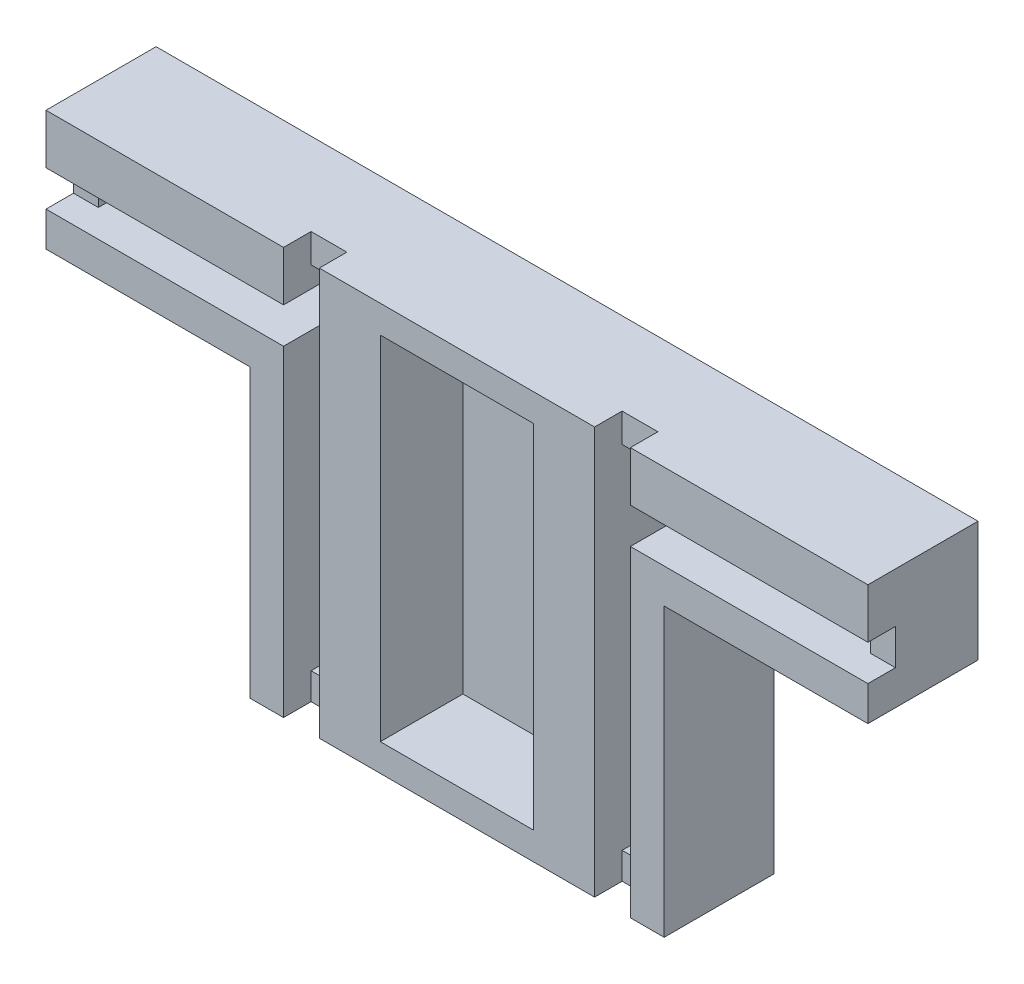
ISO-10303-21;
HEADER;
FILE_DESCRIPTION(('STEP AP214'),'2;1');
FILE_NAME('part.step','',(''),(''),'','','');
FILE_SCHEMA(('AUTOMOTIVE_DESIGN { 1 0 10303 214 1 1 1 1 }'));
ENDSEC;
DATA;
#1=APPLICATION_CONTEXT('core data for automotive mechanical design processes');
#2=APPLICATION_PROTOCOL_DEFINITION('international standard','automotive_design',2000,#1);
#3=PRODUCT_CONTEXT('',#1,'mechanical');
#4=PRODUCT('Part','Part','',(#3));
#5=PRODUCT_RELATED_PRODUCT_CATEGORY('part','',(#4));
#6=PRODUCT_DEFINITION_FORMATION('','',#4);
#7=PRODUCT_DEFINITION_CONTEXT('part definition',#1,'design');
#8=PRODUCT_DEFINITION('design','',#6,#7);
#9=PRODUCT_DEFINITION_SHAPE('','',#8);
#10=(LENGTH_UNIT() NAMED_UNIT(*) SI_UNIT(.MILLI.,.METRE.));
#11=(NAMED_UNIT(*) PLANE_ANGLE_UNIT() SI_UNIT($,.RADIAN.));
#12=(NAMED_UNIT(*) SI_UNIT($,.STERADIAN.) SOLID_ANGLE_UNIT());
#13=UNCERTAINTY_MEASURE_WITH_UNIT(LENGTH_MEASURE(1.E-05),#10,'distance_accuracy_value','');
#14=(GEOMETRIC_REPRESENTATION_CONTEXT(3) GLOBAL_UNCERTAINTY_ASSIGNED_CONTEXT((#13)) GLOBAL_UNIT_ASSIGNED_CONTEXT((#10,
#11,#12)) REPRESENTATION_CONTEXT('',''));
#15=CARTESIAN_POINT('',(0.,0.,0.));
#16=DIRECTION('',(0.,0.,1.));
#17=DIRECTION('',(1.,0.,0.));
#18=AXIS2_PLACEMENT_3D('',#15,#16,#17);
#19=CARTESIAN_POINT('',(0.,0.,20.));
#20=DIRECTION('',(0.,0.,-1.));
#21=DIRECTION('',(-1.,0.,0.));
#22=AXIS2_PLACEMENT_3D('',#19,#20,#21);
#23=PLANE('',#22);
#24=DIRECTION('',(0.,1.,0.));
#25=VECTOR('',#24,1.);
#26=CARTESIAN_POINT('',(60.7296788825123,0.,20.));
#27=LINE('',#26,#25);
#28=CARTESIAN_POINT('',(60.7296788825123,5.00000000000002,20.));
#29=VERTEX_POINT('',#28);
#30=CARTESIAN_POINT('',(60.7296788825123,68.97,20.));
#31=VERTEX_POINT('',#30);
#32=EDGE_CURVE('E446',#29,#31,#27,.T.);
#33=ORIENTED_EDGE('',*,*,#32,.T.);
#34=DIRECTION('',(-1.,0.,0.));
#35=VECTOR('',#34,1.);
#36=CARTESIAN_POINT('',(0.,68.97,20.));
#37=LINE('',#36,#35);
#38=CARTESIAN_POINT('',(88.5703211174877,68.97,20.));
#39=VERTEX_POINT('',#38);
#40=EDGE_CURVE('E451',#39,#31,#37,.T.);
#41=ORIENTED_EDGE('',*,*,#40,.F.);
#42=DIRECTION('',(0.,1.,0.));
#43=VECTOR('',#42,1.);
#44=CARTESIAN_POINT('',(88.5703211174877,0.,20.));
#45=LINE('',#44,#43);
#46=CARTESIAN_POINT('',(88.5703211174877,5.00000000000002,20.));
#47=VERTEX_POINT('',#46);
#48=EDGE_CURVE('E465',#47,#39,#45,.T.);
#49=ORIENTED_EDGE('',*,*,#48,.F.);
#50=DIRECTION('',(-1.,0.,0.));
#51=VECTOR('',#50,1.);
#52=CARTESIAN_POINT('',(0.,5.00000000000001,20.));
#53=LINE('',#52,#51);
#54=EDGE_CURVE('E462',#47,#29,#53,.T.);
#55=ORIENTED_EDGE('',*,*,#54,.T.);
#56=EDGE_LOOP('',(#33,#41,#49,#55));
#57=FACE_BOUND('',#56,.T.);
#58=DIRECTION('',(0.,-1.,0.));
#59=VECTOR('',#58,1.);
#60=CARTESIAN_POINT('',(99.65,0.,20.));
#61=LINE('',#60,#59);
#62=CARTESIAN_POINT('',(99.65,73.97,20.));
#63=VERTEX_POINT('',#62);
#64=CARTESIAN_POINT('',(99.65,0.,20.));
#65=VERTEX_POINT('',#64);
#66=EDGE_CURVE('E499',#63,#65,#61,.T.);
#67=ORIENTED_EDGE('',*,*,#66,.F.);
#68=DIRECTION('',(-1.,0.,0.));
#69=VECTOR('',#68,1.);
#70=CARTESIAN_POINT('',(0.,73.97,20.));
#71=LINE('',#70,#69);
#72=CARTESIAN_POINT('',(49.65,73.97,20.));
#73=VERTEX_POINT('',#72);
#74=EDGE_CURVE('E399',#63,#73,#71,.T.);
#75=ORIENTED_EDGE('',*,*,#74,.T.);
#76=DIRECTION('',(0.,-1.,0.));
#77=VECTOR('',#76,1.);
#78=CARTESIAN_POINT('',(49.65,0.,20.));
#79=LINE('',#78,#77);
#80=CARTESIAN_POINT('',(49.65,0.,20.));
#81=VERTEX_POINT('',#80);
#82=EDGE_CURVE('E351',#73,#81,#79,.T.);
#83=ORIENTED_EDGE('',*,*,#82,.T.);
#84=DIRECTION('',(1.,0.,0.));
#85=VECTOR('',#84,1.);
#86=CARTESIAN_POINT('',(0.,0.,20.));
#87=LINE('',#86,#85);
#88=EDGE_CURVE('E391',#81,#65,#87,.T.);
#89=ORIENTED_EDGE('',*,*,#88,.T.);
#90=EDGE_LOOP('',(#67,#75,#83,#89));
#91=FACE_BOUND('',#90,.T.);
#92=ADVANCED_FACE('F36',(#57,#91),#23,.F.);
#93=DIRECTION('',(0.,-1.,0.));
#94=VECTOR('',#93,1.);
#95=CARTESIAN_POINT('',(43.15,0.,20.));
#96=LINE('',#95,#94);
#97=CARTESIAN_POINT('',(43.15,73.97,20.));
#98=VERTEX_POINT('',#97);
#99=CARTESIAN_POINT('',(43.15,64.92,20.));
#100=VERTEX_POINT('',#99);
#101=EDGE_CURVE('E353',#98,#100,#96,.T.);
#102=ORIENTED_EDGE('',*,*,#101,.F.);
#103=CARTESIAN_POINT('',(0.,73.97,20.));
#104=VERTEX_POINT('',#103);
#105=EDGE_CURVE('E395',#98,#104,#71,.T.);
#106=ORIENTED_EDGE('',*,*,#105,.T.);
#107=DIRECTION('',(0.,-1.,0.));
#108=VECTOR('',#107,1.);
#109=CARTESIAN_POINT('',(0.,0.,20.));
#110=LINE('',#109,#108);
#111=CARTESIAN_POINT('',(0.,64.92,20.));
#112=VERTEX_POINT('',#111);
#113=EDGE_CURVE('E382',#104,#112,#110,.T.);
#114=ORIENTED_EDGE('',*,*,#113,.T.);
#115=DIRECTION('',(1.,0.,0.));
#116=VECTOR('',#115,1.);
#117=CARTESIAN_POINT('',(0.,64.92,20.));
#118=LINE('',#117,#116);
#119=EDGE_CURVE('E355',#112,#100,#118,.T.);
#120=ORIENTED_EDGE('',*,*,#119,.T.);
#121=EDGE_LOOP('',(#102,#106,#114,#120));
#122=FACE_BOUND('',#121,.T.);
#123=ADVANCED_FACE('F681',(#122),#23,.F.);
#124=DIRECTION('',(1.,0.,0.));
#125=VECTOR('',#124,1.);
#126=CARTESIAN_POINT('',(0.,58.42,20.));
#127=LINE('',#126,#125);
#128=CARTESIAN_POINT('',(0.,58.42,20.));
#129=VERTEX_POINT('',#128);
#130=CARTESIAN_POINT('',(43.15,58.42,20.));
#131=VERTEX_POINT('',#130);
#132=EDGE_CURVE('E332',#129,#131,#127,.T.);
#133=ORIENTED_EDGE('',*,*,#132,.F.);
#134=CARTESIAN_POINT('',(0.,52.121187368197,20.));
#135=VERTEX_POINT('',#134);
#136=EDGE_CURVE('E386',#129,#135,#110,.T.);
#137=ORIENTED_EDGE('',*,*,#136,.T.);
#138=DIRECTION('',(-1.,0.,0.));
#139=VECTOR('',#138,1.);
#140=CARTESIAN_POINT('',(0.,52.121187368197,20.));
#141=LINE('',#140,#139);
#142=CARTESIAN_POINT('',(37.0145690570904,52.121187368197,20.));
#143=VERTEX_POINT('',#142);
#144=EDGE_CURVE('E434',#143,#135,#141,.T.);
#145=ORIENTED_EDGE('',*,*,#144,.F.);
#146=DIRECTION('',(0.,1.,0.));
#147=VECTOR('',#146,1.);
#148=CARTESIAN_POINT('',(37.0145690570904,0.,20.));
#149=LINE('',#148,#147);
#150=CARTESIAN_POINT('',(37.0145690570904,0.,20.));
#151=VERTEX_POINT('',#150);
#152=EDGE_CURVE('E438',#151,#143,#149,.T.);
#153=ORIENTED_EDGE('',*,*,#152,.F.);
#154=CARTESIAN_POINT('',(43.15,0.,20.));
#155=VERTEX_POINT('',#154);
#156=EDGE_CURVE('E387',#151,#155,#87,.T.);
#157=ORIENTED_EDGE('',*,*,#156,.T.);
#158=EDGE_CURVE('E349',#131,#155,#96,.T.);
#159=ORIENTED_EDGE('',*,*,#158,.F.);
#160=EDGE_LOOP('',(#133,#137,#145,#153,#157,#159));
#161=FACE_BOUND('',#160,.T.);
#162=ADVANCED_FACE('F677',(#161),#23,.F.);
#163=CARTESIAN_POINT('',(4.50000000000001,0.,5.));
#164=DIRECTION('',(-1.,0.,0.));
#165=DIRECTION('',(0.,-1.,0.));
#166=AXIS2_PLACEMENT_3D('',#163,#164,#165);
#167=PLANE('',#166);
#168=DIRECTION('',(0.,1.,0.));
#169=VECTOR('',#168,1.);
#170=CARTESIAN_POINT('',(4.5,58.42,15.));
#171=LINE('',#170,#169);
#172=CARTESIAN_POINT('',(4.5,58.42,15.));
#173=VERTEX_POINT('',#172);
#174=CARTESIAN_POINT('',(4.5,64.92,15.));
#175=VERTEX_POINT('',#174);
#176=EDGE_CURVE('E552',#173,#175,#171,.T.);
#177=ORIENTED_EDGE('',*,*,#176,.F.);
#178=DIRECTION('',(0.,0.,1.));
#179=VECTOR('',#178,1.);
#180=CARTESIAN_POINT('',(4.5,58.42,5.));
#181=LINE('',#180,#179);
#182=CARTESIAN_POINT('',(4.5,58.42,5.));
#183=VERTEX_POINT('',#182);
#184=EDGE_CURVE('E363',#183,#173,#181,.T.);
#185=ORIENTED_EDGE('',*,*,#184,.F.);
#186=DIRECTION('',(0.,-1.,0.));
#187=VECTOR('',#186,1.);
#188=CARTESIAN_POINT('',(4.50000000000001,0.,5.));
#189=LINE('',#188,#187);
#190=CARTESIAN_POINT('',(4.5,64.92,5.));
#191=VERTEX_POINT('',#190);
#192=EDGE_CURVE('E342',#191,#183,#189,.T.);
#193=ORIENTED_EDGE('',*,*,#192,.F.);
#194=DIRECTION('',(0.,0.,1.));
#195=VECTOR('',#194,1.);
#196=CARTESIAN_POINT('',(4.5,64.92,5.));
#197=LINE('',#196,#195);
#198=EDGE_CURVE('E366',#191,#175,#197,.T.);
#199=ORIENTED_EDGE('',*,*,#198,.T.);
#200=EDGE_LOOP('',(#177,#185,#193,#199));
#201=FACE_BOUND('',#200,.T.);
#202=ADVANCED_FACE('F676',(#201),#167,.F.);
#203=DIRECTION('',(0.,-1.,0.));
#204=VECTOR('',#203,1.);
#205=CARTESIAN_POINT('',(106.15,0.,20.));
#206=LINE('',#205,#204);
#207=CARTESIAN_POINT('',(106.15,58.42,20.));
#208=VERTEX_POINT('',#207);
#209=CARTESIAN_POINT('',(106.15,0.,20.));
#210=VERTEX_POINT('',#209);
#211=EDGE_CURVE('E500',#208,#210,#206,.T.);
#212=ORIENTED_EDGE('',*,*,#211,.T.);
#213=CARTESIAN_POINT('',(112.28543094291,0.,20.));
#214=VERTEX_POINT('',#213);
#215=EDGE_CURVE('E385',#210,#214,#87,.T.);
#216=ORIENTED_EDGE('',*,*,#215,.T.);
#217=DIRECTION('',(0.,-1.,0.));
#218=VECTOR('',#217,1.);
#219=CARTESIAN_POINT('',(112.28543094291,0.,20.));
#220=LINE('',#219,#218);
#221=CARTESIAN_POINT('',(112.28543094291,52.121187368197,20.));
#222=VERTEX_POINT('',#221);
#223=EDGE_CURVE('E617',#222,#214,#220,.T.);
#224=ORIENTED_EDGE('',*,*,#223,.F.);
#225=DIRECTION('',(-1.,0.,0.));
#226=VECTOR('',#225,1.);
#227=CARTESIAN_POINT('',(149.3,52.121187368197,20.));
#228=LINE('',#227,#226);
#229=CARTESIAN_POINT('',(149.3,52.121187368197,20.));
#230=VERTEX_POINT('',#229);
#231=EDGE_CURVE('E610',#230,#222,#228,.T.);
#232=ORIENTED_EDGE('',*,*,#231,.F.);
#233=DIRECTION('',(0.,1.,0.));
#234=VECTOR('',#233,1.);
#235=CARTESIAN_POINT('',(149.3,0.,20.));
#236=LINE('',#235,#234);
#237=CARTESIAN_POINT('',(149.3,58.42,20.));
#238=VERTEX_POINT('',#237);
#239=EDGE_CURVE('E392',#230,#238,#236,.T.);
#240=ORIENTED_EDGE('',*,*,#239,.T.);
#241=DIRECTION('',(-1.,0.,0.));
#242=VECTOR('',#241,1.);
#243=CARTESIAN_POINT('',(0.,58.42,20.));
#244=LINE('',#243,#242);
#245=EDGE_CURVE('E483',#238,#208,#244,.T.);
#246=ORIENTED_EDGE('',*,*,#245,.T.);
#247=EDGE_LOOP('',(#212,#216,#224,#232,#240,#246));
#248=FACE_BOUND('',#247,.T.);
#249=ADVANCED_FACE('F636',(#248),#23,.F.);
#250=CARTESIAN_POINT('',(149.3,73.97,20.));
#251=VERTEX_POINT('',#250);
#252=CARTESIAN_POINT('',(106.15,73.97,20.));
#253=VERTEX_POINT('',#252);
#254=EDGE_CURVE('E396',#251,#253,#71,.T.);
#255=ORIENTED_EDGE('',*,*,#254,.T.);
#256=CARTESIAN_POINT('',(106.15,64.92,20.));
#257=VERTEX_POINT('',#256);
#258=EDGE_CURVE('E496',#253,#257,#206,.T.);
#259=ORIENTED_EDGE('',*,*,#258,.T.);
#260=DIRECTION('',(-1.,0.,0.));
#261=VECTOR('',#260,1.);
#262=CARTESIAN_POINT('',(0.,64.92,20.));
#263=LINE('',#262,#261);
#264=CARTESIAN_POINT('',(149.3,64.92,20.));
#265=VERTEX_POINT('',#264);
#266=EDGE_CURVE('E472',#265,#257,#263,.T.);
#267=ORIENTED_EDGE('',*,*,#266,.F.);
#268=EDGE_CURVE('E390',#265,#251,#236,.T.);
#269=ORIENTED_EDGE('',*,*,#268,.T.);
#270=EDGE_LOOP('',(#255,#259,#267,#269));
#271=FACE_BOUND('',#270,.T.);
#272=ADVANCED_FACE('F669',(#271),#23,.F.);
#273=CARTESIAN_POINT('',(0.,0.,20.));
#274=DIRECTION('',(1.,0.,0.));
#275=DIRECTION('',(0.,0.,-1.));
#276=AXIS2_PLACEMENT_3D('',#273,#274,#275);
#277=PLANE('',#276);
#278=ORIENTED_EDGE('',*,*,#136,.F.);
#279=DIRECTION('',(0.,0.,1.));
#280=VECTOR('',#279,1.);
#281=CARTESIAN_POINT('',(0.,58.42,15.));
#282=LINE('',#281,#280);
#283=CARTESIAN_POINT('',(0.,58.42,15.));
#284=VERTEX_POINT('',#283);
#285=EDGE_CURVE('E564',#284,#129,#282,.T.);
#286=ORIENTED_EDGE('',*,*,#285,.F.);
#287=DIRECTION('',(0.,-1.,0.));
#288=VECTOR('',#287,1.);
#289=CARTESIAN_POINT('',(0.,58.42,15.));
#290=LINE('',#289,#288);
#291=CARTESIAN_POINT('',(0.,64.92,15.));
#292=VERTEX_POINT('',#291);
#293=EDGE_CURVE('E559',#292,#284,#290,.T.);
#294=ORIENTED_EDGE('',*,*,#293,.F.);
#295=DIRECTION('',(0.,0.,1.));
#296=VECTOR('',#295,1.);
#297=CARTESIAN_POINT('',(0.,64.92,15.));
#298=LINE('',#297,#296);
#299=EDGE_CURVE('E563',#292,#112,#298,.T.);
#300=ORIENTED_EDGE('',*,*,#299,.T.);
#301=ORIENTED_EDGE('',*,*,#113,.F.);
#302=DIRECTION('',(0.,0.,-1.));
#303=VECTOR('',#302,1.);
#304=CARTESIAN_POINT('',(0.,73.97,20.));
#305=LINE('',#304,#303);
#306=CARTESIAN_POINT('',(0.,73.97,0.));
#307=VERTEX_POINT('',#306);
#308=EDGE_CURVE('E44',#104,#307,#305,.T.);
#309=ORIENTED_EDGE('',*,*,#308,.T.);
#310=DIRECTION('',(0.,-1.,0.));
#311=VECTOR('',#310,1.);
#312=CARTESIAN_POINT('',(0.,0.,0.));
#313=LINE('',#312,#311);
#314=CARTESIAN_POINT('',(0.,52.121187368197,0.));
#315=VERTEX_POINT('',#314);
#316=EDGE_CURVE('E362',#307,#315,#313,.T.);
#317=ORIENTED_EDGE('',*,*,#316,.T.);
#318=DIRECTION('',(0.,0.,1.));
#319=VECTOR('',#318,1.);
#320=CARTESIAN_POINT('',(0.,52.121187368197,0.));
#321=LINE('',#320,#319);
#322=EDGE_CURVE('E444',#315,#135,#321,.T.);
#323=ORIENTED_EDGE('',*,*,#322,.T.);
#324=EDGE_LOOP('',(#278,#286,#294,#300,#301,#309,#317,#323));
#325=FACE_BOUND('',#324,.T.);
#326=ADVANCED_FACE('F38',(#325),#277,.F.);
#327=CARTESIAN_POINT('',(0.,0.,20.));
#328=DIRECTION('',(0.,1.,0.));
#329=DIRECTION('',(0.,0.,1.));
#330=AXIS2_PLACEMENT_3D('',#327,#328,#329);
#331=PLANE('',#330);
#332=ORIENTED_EDGE('',*,*,#88,.F.);
#333=DIRECTION('',(0.,0.,1.));
#334=VECTOR('',#333,1.);
#335=CARTESIAN_POINT('',(49.65,0.,15.));
#336=LINE('',#335,#334);
#337=CARTESIAN_POINT('',(49.65,0.,15.));
#338=VERTEX_POINT('',#337);
#339=EDGE_CURVE('E580',#338,#81,#336,.T.);
#340=ORIENTED_EDGE('',*,*,#339,.F.);
#341=DIRECTION('',(1.,0.,0.));
#342=VECTOR('',#341,1.);
#343=CARTESIAN_POINT('',(49.65,0.,15.));
#344=LINE('',#343,#342);
#345=CARTESIAN_POINT('',(43.15,0.,15.));
#346=VERTEX_POINT('',#345);
#347=EDGE_CURVE('E576',#346,#338,#344,.T.);
#348=ORIENTED_EDGE('',*,*,#347,.F.);
#349=DIRECTION('',(0.,0.,1.));
#350=VECTOR('',#349,1.);
#351=CARTESIAN_POINT('',(43.15,0.,15.));
#352=LINE('',#351,#350);
#353=EDGE_CURVE('E579',#346,#155,#352,.T.);
#354=ORIENTED_EDGE('',*,*,#353,.T.);
#355=ORIENTED_EDGE('',*,*,#156,.F.);
#356=DIRECTION('',(0.,0.,1.));
#357=VECTOR('',#356,1.);
#358=CARTESIAN_POINT('',(37.0145690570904,0.,0.));
#359=LINE('',#358,#357);
#360=CARTESIAN_POINT('',(37.0145690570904,0.,0.));
#361=VERTEX_POINT('',#360);
#362=EDGE_CURVE('E430',#361,#151,#359,.T.);
#363=ORIENTED_EDGE('',*,*,#362,.F.);
#364=DIRECTION('',(1.,0.,0.));
#365=VECTOR('',#364,1.);
#366=CARTESIAN_POINT('',(0.,0.,0.));
#367=LINE('',#366,#365);
#368=CARTESIAN_POINT('',(112.28543094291,0.,0.));
#369=VERTEX_POINT('',#368);
#370=EDGE_CURVE('E402',#361,#369,#367,.T.);
#371=ORIENTED_EDGE('',*,*,#370,.T.);
#372=DIRECTION('',(0.,0.,1.));
#373=VECTOR('',#372,1.);
#374=CARTESIAN_POINT('',(112.28543094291,0.,0.));
#375=LINE('',#374,#373);
#376=EDGE_CURVE('E441',#369,#214,#375,.T.);
#377=ORIENTED_EDGE('',*,*,#376,.T.);
#378=ORIENTED_EDGE('',*,*,#215,.F.);
#379=DIRECTION('',(0.,0.,1.));
#380=VECTOR('',#379,1.);
#381=CARTESIAN_POINT('',(106.15,0.,15.));
#382=LINE('',#381,#380);
#383=CARTESIAN_POINT('',(106.15,0.,15.));
#384=VERTEX_POINT('',#383);
#385=EDGE_CURVE('E593',#384,#210,#382,.T.);
#386=ORIENTED_EDGE('',*,*,#385,.F.);
#387=DIRECTION('',(1.,0.,0.));
#388=VECTOR('',#387,1.);
#389=CARTESIAN_POINT('',(106.15,0.,15.));
#390=LINE('',#389,#388);
#391=CARTESIAN_POINT('',(99.65,0.,15.));
#392=VERTEX_POINT('',#391);
#393=EDGE_CURVE('E590',#392,#384,#390,.T.);
#394=ORIENTED_EDGE('',*,*,#393,.F.);
#395=DIRECTION('',(0.,0.,1.));
#396=VECTOR('',#395,1.);
#397=CARTESIAN_POINT('',(99.65,0.,15.));
#398=LINE('',#397,#396);
#399=EDGE_CURVE('E592',#392,#65,#398,.T.);
#400=ORIENTED_EDGE('',*,*,#399,.T.);
#401=EDGE_LOOP('',(#332,#340,#348,#354,#355,#363,#371,#377,#378,#386,#394,#400));
#402=FACE_BOUND('',#401,.T.);
#403=ADVANCED_FACE('F661',(#402),#331,.F.);
#404=CARTESIAN_POINT('',(149.3,0.,20.));
#405=DIRECTION('',(-1.,0.,0.));
#406=DIRECTION('',(0.,0.,1.));
#407=AXIS2_PLACEMENT_3D('',#404,#405,#406);
#408=PLANE('',#407);
#409=ORIENTED_EDGE('',*,*,#268,.F.);
#410=DIRECTION('',(0.,0.,1.));
#411=VECTOR('',#410,1.);
#412=CARTESIAN_POINT('',(149.3,64.92,15.));
#413=LINE('',#412,#411);
#414=CARTESIAN_POINT('',(149.3,64.92,15.));
#415=VERTEX_POINT('',#414);
#416=EDGE_CURVE('E607',#415,#265,#413,.T.);
#417=ORIENTED_EDGE('',*,*,#416,.F.);
#418=DIRECTION('',(0.,1.,0.));
#419=VECTOR('',#418,1.);
#420=CARTESIAN_POINT('',(149.3,58.42,15.));
#421=LINE('',#420,#419);
#422=CARTESIAN_POINT('',(149.3,58.42,15.));
#423=VERTEX_POINT('',#422);
#424=EDGE_CURVE('E602',#423,#415,#421,.T.);
#425=ORIENTED_EDGE('',*,*,#424,.F.);
#426=DIRECTION('',(0.,0.,1.));
#427=VECTOR('',#426,1.);
#428=CARTESIAN_POINT('',(149.3,58.42,15.));
#429=LINE('',#428,#427);
#430=EDGE_CURVE('E606',#423,#238,#429,.T.);
#431=ORIENTED_EDGE('',*,*,#430,.T.);
#432=ORIENTED_EDGE('',*,*,#239,.F.);
#433=DIRECTION('',(0.,0.,1.));
#434=VECTOR('',#433,1.);
#435=CARTESIAN_POINT('',(149.3,52.121187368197,0.));
#436=LINE('',#435,#434);
#437=CARTESIAN_POINT('',(149.3,52.121187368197,0.));
#438=VERTEX_POINT('',#437);
#439=EDGE_CURVE('E619',#438,#230,#436,.T.);
#440=ORIENTED_EDGE('',*,*,#439,.F.);
#441=DIRECTION('',(0.,1.,0.));
#442=VECTOR('',#441,1.);
#443=CARTESIAN_POINT('',(149.3,0.,0.));
#444=LINE('',#443,#442);
#445=CARTESIAN_POINT('',(149.3,73.97,0.));
#446=VERTEX_POINT('',#445);
#447=EDGE_CURVE('E405',#438,#446,#444,.T.);
#448=ORIENTED_EDGE('',*,*,#447,.T.);
#449=DIRECTION('',(0.,0.,-1.));
#450=VECTOR('',#449,1.);
#451=CARTESIAN_POINT('',(149.3,73.97,20.));
#452=LINE('',#451,#450);
#453=EDGE_CURVE('E11',#251,#446,#452,.T.);
#454=ORIENTED_EDGE('',*,*,#453,.F.);
#455=EDGE_LOOP('',(#409,#417,#425,#431,#432,#440,#448,#454));
#456=FACE_BOUND('',#455,.T.);
#457=ADVANCED_FACE('F638',(#456),#408,.F.);
#458=CARTESIAN_POINT('',(0.,73.97,20.));
#459=DIRECTION('',(0.,-1.,0.));
#460=DIRECTION('',(0.,0.,-1.));
#461=AXIS2_PLACEMENT_3D('',#458,#459,#460);
#462=PLANE('',#461);
#463=ORIENTED_EDGE('',*,*,#74,.F.);
#464=DIRECTION('',(0.,0.,1.));
#465=VECTOR('',#464,1.);
#466=CARTESIAN_POINT('',(99.65,73.97,15.));
#467=LINE('',#466,#465);
#468=CARTESIAN_POINT('',(99.65,73.97,15.));
#469=VERTEX_POINT('',#468);
#470=EDGE_CURVE('E537',#469,#63,#467,.T.);
#471=ORIENTED_EDGE('',*,*,#470,.F.);
#472=DIRECTION('',(-1.,0.,0.));
#473=VECTOR('',#472,1.);
#474=CARTESIAN_POINT('',(99.65,73.97,15.));
#475=LINE('',#474,#473);
#476=CARTESIAN_POINT('',(106.15,73.97,15.));
#477=VERTEX_POINT('',#476);
#478=EDGE_CURVE('E296',#477,#469,#475,.T.);
#479=ORIENTED_EDGE('',*,*,#478,.F.);
#480=DIRECTION('',(0.,0.,1.));
#481=VECTOR('',#480,1.);
#482=CARTESIAN_POINT('',(106.15,73.97,15.));
#483=LINE('',#482,#481);
#484=EDGE_CURVE('E533',#477,#253,#483,.T.);
#485=ORIENTED_EDGE('',*,*,#484,.T.);
#486=ORIENTED_EDGE('',*,*,#254,.F.);
#487=ORIENTED_EDGE('',*,*,#453,.T.);
#488=DIRECTION('',(-1.,0.,0.));
#489=VECTOR('',#488,1.);
#490=CARTESIAN_POINT('',(0.,73.97,0.));
#491=LINE('',#490,#489);
#492=EDGE_CURVE('E407',#446,#307,#491,.T.);
#493=ORIENTED_EDGE('',*,*,#492,.T.);
#494=ORIENTED_EDGE('',*,*,#308,.F.);
#495=ORIENTED_EDGE('',*,*,#105,.F.);
#496=DIRECTION('',(0.,0.,1.));
#497=VECTOR('',#496,1.);
#498=CARTESIAN_POINT('',(43.15,73.97,15.));
#499=LINE('',#498,#497);
#500=CARTESIAN_POINT('',(43.15,73.97,15.));
#501=VERTEX_POINT('',#500);
#502=EDGE_CURVE('E549',#501,#98,#499,.T.);
#503=ORIENTED_EDGE('',*,*,#502,.F.);
#504=DIRECTION('',(-1.,0.,0.));
#505=VECTOR('',#504,1.);
#506=CARTESIAN_POINT('',(43.15,73.97,15.));
#507=LINE('',#506,#505);
#508=CARTESIAN_POINT('',(49.65,73.97,15.));
#509=VERTEX_POINT('',#508);
#510=EDGE_CURVE('E545',#509,#501,#507,.T.);
#511=ORIENTED_EDGE('',*,*,#510,.F.);
#512=DIRECTION('',(0.,0.,1.));
#513=VECTOR('',#512,1.);
#514=CARTESIAN_POINT('',(49.65,73.97,15.));
#515=LINE('',#514,#513);
#516=EDGE_CURVE('E548',#509,#73,#515,.T.);
#517=ORIENTED_EDGE('',*,*,#516,.T.);
#518=EDGE_LOOP('',(#463,#471,#479,#485,#486,#487,#493,#494,#495,#503,#511,#517));
#519=FACE_BOUND('',#518,.T.);
#520=ADVANCED_FACE('F667',(#519),#462,.F.);
#521=CARTESIAN_POINT('',(0.,0.,0.));
#522=DIRECTION('',(0.,0.,-1.));
#523=DIRECTION('',(-1.,0.,0.));
#524=AXIS2_PLACEMENT_3D('',#521,#522,#523);
#525=PLANE('',#524);
#526=DIRECTION('',(0.,-1.,0.));
#527=VECTOR('',#526,1.);
#528=CARTESIAN_POINT('',(112.28543094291,0.,0.));
#529=LINE('',#528,#527);
#530=CARTESIAN_POINT('',(112.28543094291,52.121187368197,0.));
#531=VERTEX_POINT('',#530);
#532=EDGE_CURVE('E616',#531,#369,#529,.T.);
#533=ORIENTED_EDGE('',*,*,#532,.T.);
#534=ORIENTED_EDGE('',*,*,#370,.F.);
#535=DIRECTION('',(0.,1.,0.));
#536=VECTOR('',#535,1.);
#537=CARTESIAN_POINT('',(37.0145690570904,0.,0.));
#538=LINE('',#537,#536);
#539=CARTESIAN_POINT('',(37.0145690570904,52.121187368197,0.));
#540=VERTEX_POINT('',#539);
#541=EDGE_CURVE('E427',#361,#540,#538,.T.);
#542=ORIENTED_EDGE('',*,*,#541,.T.);
#543=DIRECTION('',(-1.,0.,0.));
#544=VECTOR('',#543,1.);
#545=CARTESIAN_POINT('',(0.,52.121187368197,0.));
#546=LINE('',#545,#544);
#547=EDGE_CURVE('E425',#540,#315,#546,.T.);
#548=ORIENTED_EDGE('',*,*,#547,.T.);
#549=ORIENTED_EDGE('',*,*,#316,.F.);
#550=ORIENTED_EDGE('',*,*,#492,.F.);
#551=ORIENTED_EDGE('',*,*,#447,.F.);
#552=DIRECTION('',(-1.,0.,0.));
#553=VECTOR('',#552,1.);
#554=CARTESIAN_POINT('',(149.3,52.121187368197,0.));
#555=LINE('',#554,#553);
#556=EDGE_CURVE('E613',#438,#531,#555,.T.);
#557=ORIENTED_EDGE('',*,*,#556,.T.);
#558=EDGE_LOOP('',(#533,#534,#542,#548,#549,#550,#551,#557));
#559=FACE_BOUND('',#558,.T.);
#560=ADVANCED_FACE('F422',(#559),#525,.T.);
#561=CARTESIAN_POINT('',(43.15,0.,5.));
#562=DIRECTION('',(-1.,0.,0.));
#563=DIRECTION('',(0.,-1.,0.));
#564=AXIS2_PLACEMENT_3D('',#561,#562,#563);
#565=PLANE('',#564);
#566=ORIENTED_EDGE('',*,*,#158,.T.);
#567=ORIENTED_EDGE('',*,*,#353,.F.);
#568=DIRECTION('',(0.,-1.,0.));
#569=VECTOR('',#568,1.);
#570=CARTESIAN_POINT('',(43.15,4.87000000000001,15.));
#571=LINE('',#570,#569);
#572=CARTESIAN_POINT('',(43.15,4.87000000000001,15.));
#573=VERTEX_POINT('',#572);
#574=EDGE_CURVE('E573',#573,#346,#571,.T.);
#575=ORIENTED_EDGE('',*,*,#574,.F.);
#576=DIRECTION('',(0.,0.,1.));
#577=VECTOR('',#576,1.);
#578=CARTESIAN_POINT('',(43.15,4.87000000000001,5.));
#579=LINE('',#578,#577);
#580=CARTESIAN_POINT('',(43.15,4.87000000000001,5.));
#581=VERTEX_POINT('',#580);
#582=EDGE_CURVE('E348',#581,#573,#579,.T.);
#583=ORIENTED_EDGE('',*,*,#582,.F.);
#584=DIRECTION('',(0.,-1.,0.));
#585=VECTOR('',#584,1.);
#586=CARTESIAN_POINT('',(43.15,0.,5.));
#587=LINE('',#586,#585);
#588=CARTESIAN_POINT('',(43.15,58.42,5.));
#589=VERTEX_POINT('',#588);
#590=EDGE_CURVE('E328',#589,#581,#587,.T.);
#591=ORIENTED_EDGE('',*,*,#590,.F.);
#592=DIRECTION('',(0.,0.,1.));
#593=VECTOR('',#592,1.);
#594=CARTESIAN_POINT('',(43.15,58.42,5.));
#595=LINE('',#594,#593);
#596=EDGE_CURVE('E360',#589,#131,#595,.T.);
#597=ORIENTED_EDGE('',*,*,#596,.T.);
#598=EDGE_LOOP('',(#566,#567,#575,#583,#591,#597));
#599=FACE_BOUND('',#598,.T.);
#600=ADVANCED_FACE('F787',(#599),#565,.F.);
#601=CARTESIAN_POINT('',(0.,58.42,5.));
#602=DIRECTION('',(0.,-1.,0.));
#603=DIRECTION('',(0.,0.,-1.));
#604=AXIS2_PLACEMENT_3D('',#601,#602,#603);
#605=PLANE('',#604);
#606=ORIENTED_EDGE('',*,*,#132,.T.);
#607=ORIENTED_EDGE('',*,*,#596,.F.);
#608=DIRECTION('',(1.,0.,0.));
#609=VECTOR('',#608,1.);
#610=CARTESIAN_POINT('',(0.,58.42,5.));
#611=LINE('',#610,#609);
#612=EDGE_CURVE('E345',#183,#589,#611,.T.);
#613=ORIENTED_EDGE('',*,*,#612,.F.);
#614=ORIENTED_EDGE('',*,*,#184,.T.);
#615=DIRECTION('',(1.,0.,0.));
#616=VECTOR('',#615,1.);
#617=CARTESIAN_POINT('',(4.5,58.42,15.));
#618=LINE('',#617,#616);
#619=EDGE_CURVE('E561',#284,#173,#618,.T.);
#620=ORIENTED_EDGE('',*,*,#619,.F.);
#621=ORIENTED_EDGE('',*,*,#285,.T.);
#622=EDGE_LOOP('',(#606,#607,#613,#614,#620,#621));
#623=FACE_BOUND('',#622,.T.);
#624=ADVANCED_FACE('F783',(#623),#605,.F.);
#625=CARTESIAN_POINT('',(0.,64.92,5.));
#626=DIRECTION('',(0.,-1.,0.));
#627=DIRECTION('',(0.,0.,-1.));
#628=AXIS2_PLACEMENT_3D('',#625,#626,#627);
#629=PLANE('',#628);
#630=ORIENTED_EDGE('',*,*,#119,.F.);
#631=ORIENTED_EDGE('',*,*,#299,.F.);
#632=DIRECTION('',(-1.,0.,0.));
#633=VECTOR('',#632,1.);
#634=CARTESIAN_POINT('',(4.5,64.92,15.));
#635=LINE('',#634,#633);
#636=EDGE_CURVE('E556',#175,#292,#635,.T.);
#637=ORIENTED_EDGE('',*,*,#636,.F.);
#638=ORIENTED_EDGE('',*,*,#198,.F.);
#639=DIRECTION('',(1.,0.,0.));
#640=VECTOR('',#639,1.);
#641=CARTESIAN_POINT('',(0.,64.92,5.));
#642=LINE('',#641,#640);
#643=CARTESIAN_POINT('',(43.15,64.92,5.));
#644=VERTEX_POINT('',#643);
#645=EDGE_CURVE('E340',#191,#644,#642,.T.);
#646=ORIENTED_EDGE('',*,*,#645,.T.);
#647=DIRECTION('',(0.,0.,1.));
#648=VECTOR('',#647,1.);
#649=CARTESIAN_POINT('',(43.15,64.92,5.));
#650=LINE('',#649,#648);
#651=EDGE_CURVE('E369',#644,#100,#650,.T.);
#652=ORIENTED_EDGE('',*,*,#651,.T.);
#653=EDGE_LOOP('',(#630,#631,#637,#638,#646,#652));
#654=FACE_BOUND('',#653,.T.);
#655=ADVANCED_FACE('F786',(#654),#629,.T.);
#656=ORIENTED_EDGE('',*,*,#101,.T.);
#657=ORIENTED_EDGE('',*,*,#651,.F.);
#658=CARTESIAN_POINT('',(43.15,68.72,5.));
#659=VERTEX_POINT('',#658);
#660=EDGE_CURVE('E333',#659,#644,#587,.T.);
#661=ORIENTED_EDGE('',*,*,#660,.F.);
#662=DIRECTION('',(0.,0.,1.));
#663=VECTOR('',#662,1.);
#664=CARTESIAN_POINT('',(43.15,68.72,5.));
#665=LINE('',#664,#663);
#666=CARTESIAN_POINT('',(43.15,68.72,15.));
#667=VERTEX_POINT('',#666);
#668=EDGE_CURVE('E371',#659,#667,#665,.T.);
#669=ORIENTED_EDGE('',*,*,#668,.T.);
#670=DIRECTION('',(0.,-1.,0.));
#671=VECTOR('',#670,1.);
#672=CARTESIAN_POINT('',(43.15,68.72,15.));
#673=LINE('',#672,#671);
#674=EDGE_CURVE('E539',#501,#667,#673,.T.);
#675=ORIENTED_EDGE('',*,*,#674,.F.);
#676=ORIENTED_EDGE('',*,*,#502,.T.);
#677=EDGE_LOOP('',(#656,#657,#661,#669,#675,#676));
#678=FACE_BOUND('',#677,.T.);
#679=ADVANCED_FACE('F695',(#678),#565,.F.);
#680=CARTESIAN_POINT('',(0.,68.72,5.));
#681=DIRECTION('',(0.,1.,0.));
#682=DIRECTION('',(0.,0.,1.));
#683=AXIS2_PLACEMENT_3D('',#680,#681,#682);
#684=PLANE('',#683);
#685=DIRECTION('',(0.,0.,1.));
#686=VECTOR('',#685,1.);
#687=CARTESIAN_POINT('',(49.65,68.72,5.));
#688=LINE('',#687,#686);
#689=CARTESIAN_POINT('',(49.65,68.72,5.));
#690=VERTEX_POINT('',#689);
#691=CARTESIAN_POINT('',(49.65,68.72,15.));
#692=VERTEX_POINT('',#691);
#693=EDGE_CURVE('E374',#690,#692,#688,.T.);
#694=ORIENTED_EDGE('',*,*,#693,.T.);
#695=DIRECTION('',(1.,0.,0.));
#696=VECTOR('',#695,1.);
#697=CARTESIAN_POINT('',(43.15,68.72,15.));
#698=LINE('',#697,#696);
#699=EDGE_CURVE('E59',#667,#692,#698,.T.);
#700=ORIENTED_EDGE('',*,*,#699,.F.);
#701=ORIENTED_EDGE('',*,*,#668,.F.);
#702=DIRECTION('',(-1.,0.,0.));
#703=VECTOR('',#702,1.);
#704=CARTESIAN_POINT('',(0.,68.72,5.));
#705=LINE('',#704,#703);
#706=EDGE_CURVE('E337',#690,#659,#705,.T.);
#707=ORIENTED_EDGE('',*,*,#706,.F.);
#708=EDGE_LOOP('',(#694,#700,#701,#707));
#709=FACE_BOUND('',#708,.T.);
#710=ADVANCED_FACE('F704',(#709),#684,.F.);
#711=CARTESIAN_POINT('',(49.65,0.,5.));
#712=DIRECTION('',(-1.,0.,0.));
#713=DIRECTION('',(0.,-1.,0.));
#714=AXIS2_PLACEMENT_3D('',#711,#712,#713);
#715=PLANE('',#714);
#716=ORIENTED_EDGE('',*,*,#82,.F.);
#717=ORIENTED_EDGE('',*,*,#516,.F.);
#718=DIRECTION('',(0.,1.,0.));
#719=VECTOR('',#718,1.);
#720=CARTESIAN_POINT('',(49.65,68.72,15.));
#721=LINE('',#720,#719);
#722=EDGE_CURVE('E543',#692,#509,#721,.T.);
#723=ORIENTED_EDGE('',*,*,#722,.F.);
#724=ORIENTED_EDGE('',*,*,#693,.F.);
#725=DIRECTION('',(0.,-1.,0.));
#726=VECTOR('',#725,1.);
#727=CARTESIAN_POINT('',(49.65,0.,5.));
#728=LINE('',#727,#726);
#729=CARTESIAN_POINT('',(49.65,4.87000000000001,5.));
#730=VERTEX_POINT('',#729);
#731=EDGE_CURVE('E335',#690,#730,#728,.T.);
#732=ORIENTED_EDGE('',*,*,#731,.T.);
#733=DIRECTION('',(0.,0.,1.));
#734=VECTOR('',#733,1.);
#735=CARTESIAN_POINT('',(49.65,4.87000000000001,5.));
#736=LINE('',#735,#734);
#737=CARTESIAN_POINT('',(49.65,4.87000000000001,15.));
#738=VERTEX_POINT('',#737);
#739=EDGE_CURVE('E377',#730,#738,#736,.T.);
#740=ORIENTED_EDGE('',*,*,#739,.T.);
#741=DIRECTION('',(0.,1.,0.));
#742=VECTOR('',#741,1.);
#743=CARTESIAN_POINT('',(49.65,4.87000000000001,15.));
#744=LINE('',#743,#742);
#745=EDGE_CURVE('E567',#338,#738,#744,.T.);
#746=ORIENTED_EDGE('',*,*,#745,.F.);
#747=ORIENTED_EDGE('',*,*,#339,.T.);
#748=EDGE_LOOP('',(#716,#717,#723,#724,#732,#740,#746,#747));
#749=FACE_BOUND('',#748,.T.);
#750=ADVANCED_FACE('F700',(#749),#715,.T.);
#751=CARTESIAN_POINT('',(0.,4.87,5.));
#752=DIRECTION('',(0.,1.,0.));
#753=DIRECTION('',(-1.,0.,0.));
#754=AXIS2_PLACEMENT_3D('',#751,#752,#753);
#755=PLANE('',#754);
#756=DIRECTION('',(-1.,0.,0.));
#757=VECTOR('',#756,1.);
#758=CARTESIAN_POINT('',(49.65,4.87000000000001,15.));
#759=LINE('',#758,#757);
#760=EDGE_CURVE('E570',#738,#573,#759,.T.);
#761=ORIENTED_EDGE('',*,*,#760,.F.);
#762=ORIENTED_EDGE('',*,*,#739,.F.);
#763=DIRECTION('',(-1.,0.,0.));
#764=VECTOR('',#763,1.);
#765=CARTESIAN_POINT('',(0.,4.87,5.));
#766=LINE('',#765,#764);
#767=EDGE_CURVE('E331',#730,#581,#766,.T.);
#768=ORIENTED_EDGE('',*,*,#767,.T.);
#769=ORIENTED_EDGE('',*,*,#582,.T.);
#770=EDGE_LOOP('',(#761,#762,#768,#769));
#771=FACE_BOUND('',#770,.T.);
#772=ADVANCED_FACE('F713',(#771),#755,.T.);
#773=CARTESIAN_POINT('',(0.,0.,5.));
#774=DIRECTION('',(0.,0.,1.));
#775=DIRECTION('',(1.,0.,0.));
#776=AXIS2_PLACEMENT_3D('',#773,#774,#775);
#777=PLANE('',#776);
#778=ORIENTED_EDGE('',*,*,#590,.T.);
#779=ORIENTED_EDGE('',*,*,#767,.F.);
#780=ORIENTED_EDGE('',*,*,#731,.F.);
#781=ORIENTED_EDGE('',*,*,#706,.T.);
#782=ORIENTED_EDGE('',*,*,#660,.T.);
#783=ORIENTED_EDGE('',*,*,#645,.F.);
#784=ORIENTED_EDGE('',*,*,#192,.T.);
#785=ORIENTED_EDGE('',*,*,#612,.T.);
#786=EDGE_LOOP('',(#778,#779,#780,#781,#782,#783,#784,#785));
#787=FACE_BOUND('',#786,.T.);
#788=ADVANCED_FACE('F707',(#787),#777,.T.);
#789=CARTESIAN_POINT('',(0.,64.92,5.));
#790=DIRECTION('',(0.,1.,0.));
#791=DIRECTION('',(0.,0.,1.));
#792=AXIS2_PLACEMENT_3D('',#789,#790,#791);
#793=PLANE('',#792);
#794=ORIENTED_EDGE('',*,*,#266,.T.);
#795=DIRECTION('',(0.,0.,1.));
#796=VECTOR('',#795,1.);
#797=CARTESIAN_POINT('',(106.15,64.92,5.));
#798=LINE('',#797,#796);
#799=CARTESIAN_POINT('',(106.15,64.92,5.));
#800=VERTEX_POINT('',#799);
#801=EDGE_CURVE('E321',#800,#257,#798,.T.);
#802=ORIENTED_EDGE('',*,*,#801,.F.);
#803=DIRECTION('',(-1.,0.,0.));
#804=VECTOR('',#803,1.);
#805=CARTESIAN_POINT('',(0.,64.92,5.));
#806=LINE('',#805,#804);
#807=CARTESIAN_POINT('',(144.8,64.92,5.));
#808=VERTEX_POINT('',#807);
#809=EDGE_CURVE('E479',#808,#800,#806,.T.);
#810=ORIENTED_EDGE('',*,*,#809,.F.);
#811=DIRECTION('',(0.,0.,1.));
#812=VECTOR('',#811,1.);
#813=CARTESIAN_POINT('',(144.8,64.92,5.));
#814=LINE('',#813,#812);
#815=CARTESIAN_POINT('',(144.8,64.92,15.));
#816=VERTEX_POINT('',#815);
#817=EDGE_CURVE('E352',#808,#816,#814,.T.);
#818=ORIENTED_EDGE('',*,*,#817,.T.);
#819=DIRECTION('',(-1.,0.,0.));
#820=VECTOR('',#819,1.);
#821=CARTESIAN_POINT('',(144.8,64.92,15.));
#822=LINE('',#821,#820);
#823=EDGE_CURVE('E604',#415,#816,#822,.T.);
#824=ORIENTED_EDGE('',*,*,#823,.F.);
#825=ORIENTED_EDGE('',*,*,#416,.T.);
#826=EDGE_LOOP('',(#794,#802,#810,#818,#824,#825));
#827=FACE_BOUND('',#826,.T.);
#828=ADVANCED_FACE('F654',(#827),#793,.F.);
#829=CARTESIAN_POINT('',(144.8,0.,5.));
#830=DIRECTION('',(-1.,0.,0.));
#831=DIRECTION('',(0.,0.,1.));
#832=AXIS2_PLACEMENT_3D('',#829,#830,#831);
#833=PLANE('',#832);
#834=DIRECTION('',(0.,-1.,0.));
#835=VECTOR('',#834,1.);
#836=CARTESIAN_POINT('',(144.8,58.42,15.));
#837=LINE('',#836,#835);
#838=CARTESIAN_POINT('',(144.8,58.42,15.));
#839=VERTEX_POINT('',#838);
#840=EDGE_CURVE('E595',#816,#839,#837,.T.);
#841=ORIENTED_EDGE('',*,*,#840,.F.);
#842=ORIENTED_EDGE('',*,*,#817,.F.);
#843=DIRECTION('',(0.,-1.,0.));
#844=VECTOR('',#843,1.);
#845=CARTESIAN_POINT('',(144.8,0.,5.));
#846=LINE('',#845,#844);
#847=CARTESIAN_POINT('',(144.8,58.42,5.));
#848=VERTEX_POINT('',#847);
#849=EDGE_CURVE('E327',#808,#848,#846,.T.);
#850=ORIENTED_EDGE('',*,*,#849,.T.);
#851=DIRECTION('',(0.,0.,1.));
#852=VECTOR('',#851,1.);
#853=CARTESIAN_POINT('',(144.8,58.42,5.));
#854=LINE('',#853,#852);
#855=EDGE_CURVE('E506',#848,#839,#854,.T.);
#856=ORIENTED_EDGE('',*,*,#855,.T.);
#857=EDGE_LOOP('',(#841,#842,#850,#856));
#858=FACE_BOUND('',#857,.T.);
#859=ADVANCED_FACE('F650',(#858),#833,.T.);
#860=CARTESIAN_POINT('',(0.,58.42,5.));
#861=DIRECTION('',(0.,1.,0.));
#862=DIRECTION('',(0.,0.,1.));
#863=AXIS2_PLACEMENT_3D('',#860,#861,#862);
#864=PLANE('',#863);
#865=ORIENTED_EDGE('',*,*,#245,.F.);
#866=ORIENTED_EDGE('',*,*,#430,.F.);
#867=DIRECTION('',(1.,0.,0.));
#868=VECTOR('',#867,1.);
#869=CARTESIAN_POINT('',(144.8,58.42,15.));
#870=LINE('',#869,#868);
#871=EDGE_CURVE('E599',#839,#423,#870,.T.);
#872=ORIENTED_EDGE('',*,*,#871,.F.);
#873=ORIENTED_EDGE('',*,*,#855,.F.);
#874=DIRECTION('',(-1.,0.,0.));
#875=VECTOR('',#874,1.);
#876=CARTESIAN_POINT('',(0.,58.42,5.));
#877=LINE('',#876,#875);
#878=CARTESIAN_POINT('',(106.15,58.42,5.));
#879=VERTEX_POINT('',#878);
#880=EDGE_CURVE('E492',#848,#879,#877,.T.);
#881=ORIENTED_EDGE('',*,*,#880,.T.);
#882=DIRECTION('',(0.,0.,1.));
#883=VECTOR('',#882,1.);
#884=CARTESIAN_POINT('',(106.15,58.42,5.));
#885=LINE('',#884,#883);
#886=EDGE_CURVE('E509',#879,#208,#885,.T.);
#887=ORIENTED_EDGE('',*,*,#886,.T.);
#888=EDGE_LOOP('',(#865,#866,#872,#873,#881,#887));
#889=FACE_BOUND('',#888,.T.);
#890=ADVANCED_FACE('F643',(#889),#864,.T.);
#891=CARTESIAN_POINT('',(106.15,0.,5.));
#892=DIRECTION('',(-1.,0.,0.));
#893=DIRECTION('',(0.,0.,1.));
#894=AXIS2_PLACEMENT_3D('',#891,#892,#893);
#895=PLANE('',#894);
#896=ORIENTED_EDGE('',*,*,#211,.F.);
#897=ORIENTED_EDGE('',*,*,#886,.F.);
#898=DIRECTION('',(0.,-1.,0.));
#899=VECTOR('',#898,1.);
#900=CARTESIAN_POINT('',(106.15,0.,5.));
#901=LINE('',#900,#899);
#902=CARTESIAN_POINT('',(106.15,4.87000000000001,5.));
#903=VERTEX_POINT('',#902);
#904=EDGE_CURVE('E486',#879,#903,#901,.T.);
#905=ORIENTED_EDGE('',*,*,#904,.T.);
#906=DIRECTION('',(0.,0.,1.));
#907=VECTOR('',#906,1.);
#908=CARTESIAN_POINT('',(106.15,4.87000000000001,5.));
#909=LINE('',#908,#907);
#910=CARTESIAN_POINT('',(106.15,4.87000000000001,15.));
#911=VERTEX_POINT('',#910);
#912=EDGE_CURVE('E319',#903,#911,#909,.T.);
#913=ORIENTED_EDGE('',*,*,#912,.T.);
#914=DIRECTION('',(0.,1.,0.));
#915=VECTOR('',#914,1.);
#916=CARTESIAN_POINT('',(106.15,4.87000000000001,15.));
#917=LINE('',#916,#915);
#918=EDGE_CURVE('E516',#384,#911,#917,.T.);
#919=ORIENTED_EDGE('',*,*,#918,.F.);
#920=ORIENTED_EDGE('',*,*,#385,.T.);
#921=EDGE_LOOP('',(#896,#897,#905,#913,#919,#920));
#922=FACE_BOUND('',#921,.T.);
#923=ADVANCED_FACE('F514',(#922),#895,.T.);
#924=CARTESIAN_POINT('',(0.,4.87000000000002,5.));
#925=DIRECTION('',(0.,-1.,0.));
#926=DIRECTION('',(1.,0.,0.));
#927=AXIS2_PLACEMENT_3D('',#924,#925,#926);
#928=PLANE('',#927);
#929=DIRECTION('',(0.,0.,1.));
#930=VECTOR('',#929,1.);
#931=CARTESIAN_POINT('',(99.65,4.87000000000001,5.));
#932=LINE('',#931,#930);
#933=CARTESIAN_POINT('',(99.65,4.87000000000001,5.));
#934=VERTEX_POINT('',#933);
#935=CARTESIAN_POINT('',(99.65,4.87000000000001,15.));
#936=VERTEX_POINT('',#935);
#937=EDGE_CURVE('E316',#934,#936,#932,.T.);
#938=ORIENTED_EDGE('',*,*,#937,.T.);
#939=DIRECTION('',(-1.,0.,0.));
#940=VECTOR('',#939,1.);
#941=CARTESIAN_POINT('',(106.15,4.87000000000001,15.));
#942=LINE('',#941,#940);
#943=EDGE_CURVE('E524',#911,#936,#942,.T.);
#944=ORIENTED_EDGE('',*,*,#943,.F.);
#945=ORIENTED_EDGE('',*,*,#912,.F.);
#946=DIRECTION('',(1.,0.,0.));
#947=VECTOR('',#946,1.);
#948=CARTESIAN_POINT('',(0.,4.87000000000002,5.));
#949=LINE('',#948,#947);
#950=EDGE_CURVE('E489',#934,#903,#949,.T.);
#951=ORIENTED_EDGE('',*,*,#950,.F.);
#952=EDGE_LOOP('',(#938,#944,#945,#951));
#953=FACE_BOUND('',#952,.T.);
#954=ADVANCED_FACE('F523',(#953),#928,.F.);
#955=CARTESIAN_POINT('',(99.65,0.,5.));
#956=DIRECTION('',(-1.,0.,0.));
#957=DIRECTION('',(0.,-1.,0.));
#958=AXIS2_PLACEMENT_3D('',#955,#956,#957);
#959=PLANE('',#958);
#960=ORIENTED_EDGE('',*,*,#66,.T.);
#961=ORIENTED_EDGE('',*,*,#399,.F.);
#962=DIRECTION('',(0.,-1.,0.));
#963=VECTOR('',#962,1.);
#964=CARTESIAN_POINT('',(99.65,4.87000000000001,15.));
#965=LINE('',#964,#963);
#966=EDGE_CURVE('E587',#936,#392,#965,.T.);
#967=ORIENTED_EDGE('',*,*,#966,.F.);
#968=ORIENTED_EDGE('',*,*,#937,.F.);
#969=DIRECTION('',(0.,-1.,0.));
#970=VECTOR('',#969,1.);
#971=CARTESIAN_POINT('',(99.65,0.,5.));
#972=LINE('',#971,#970);
#973=CARTESIAN_POINT('',(99.65,68.72,5.));
#974=VERTEX_POINT('',#973);
#975=EDGE_CURVE('E315',#974,#934,#972,.T.);
#976=ORIENTED_EDGE('',*,*,#975,.F.);
#977=DIRECTION('',(0.,0.,1.));
#978=VECTOR('',#977,1.);
#979=CARTESIAN_POINT('',(99.65,68.72,5.));
#980=LINE('',#979,#978);
#981=CARTESIAN_POINT('',(99.65,68.72,15.));
#982=VERTEX_POINT('',#981);
#983=EDGE_CURVE('E305',#974,#982,#980,.T.);
#984=ORIENTED_EDGE('',*,*,#983,.T.);
#985=DIRECTION('',(0.,-1.,0.));
#986=VECTOR('',#985,1.);
#987=CARTESIAN_POINT('',(99.65,68.72,15.));
#988=LINE('',#987,#986);
#989=EDGE_CURVE('E293',#469,#982,#988,.T.);
#990=ORIENTED_EDGE('',*,*,#989,.F.);
#991=ORIENTED_EDGE('',*,*,#470,.T.);
#992=EDGE_LOOP('',(#960,#961,#967,#968,#976,#984,#990,#991));
#993=FACE_BOUND('',#992,.T.);
#994=ADVANCED_FACE('F313',(#993),#959,.F.);
#995=CARTESIAN_POINT('',(0.,68.72,5.));
#996=DIRECTION('',(0.,-1.,0.));
#997=DIRECTION('',(0.,0.,-1.));
#998=AXIS2_PLACEMENT_3D('',#995,#996,#997);
#999=PLANE('',#998);
#1000=DIRECTION('',(1.,0.,0.));
#1001=VECTOR('',#1000,1.);
#1002=CARTESIAN_POINT('',(99.65,68.72,15.));
#1003=LINE('',#1002,#1001);
#1004=CARTESIAN_POINT('',(106.15,68.72,15.));
#1005=VERTEX_POINT('',#1004);
#1006=EDGE_CURVE('E51',#982,#1005,#1003,.T.);
#1007=ORIENTED_EDGE('',*,*,#1006,.F.);
#1008=ORIENTED_EDGE('',*,*,#983,.F.);
#1009=DIRECTION('',(1.,0.,0.));
#1010=VECTOR('',#1009,1.);
#1011=CARTESIAN_POINT('',(0.,68.72,5.));
#1012=LINE('',#1011,#1010);
#1013=CARTESIAN_POINT('',(106.15,68.72,5.));
#1014=VERTEX_POINT('',#1013);
#1015=EDGE_CURVE('E485',#974,#1014,#1012,.T.);
#1016=ORIENTED_EDGE('',*,*,#1015,.T.);
#1017=DIRECTION('',(0.,0.,1.));
#1018=VECTOR('',#1017,1.);
#1019=CARTESIAN_POINT('',(106.15,68.72,5.));
#1020=LINE('',#1019,#1018);
#1021=EDGE_CURVE('E308',#1014,#1005,#1020,.T.);
#1022=ORIENTED_EDGE('',*,*,#1021,.T.);
#1023=EDGE_LOOP('',(#1007,#1008,#1016,#1022));
#1024=FACE_BOUND('',#1023,.T.);
#1025=ADVANCED_FACE('F304',(#1024),#999,.T.);
#1026=ORIENTED_EDGE('',*,*,#258,.F.);
#1027=ORIENTED_EDGE('',*,*,#484,.F.);
#1028=DIRECTION('',(0.,1.,0.));
#1029=VECTOR('',#1028,1.);
#1030=CARTESIAN_POINT('',(106.15,68.72,15.));
#1031=LINE('',#1030,#1029);
#1032=EDGE_CURVE('E309',#1005,#477,#1031,.T.);
#1033=ORIENTED_EDGE('',*,*,#1032,.F.);
#1034=ORIENTED_EDGE('',*,*,#1021,.F.);
#1035=EDGE_CURVE('E482',#1014,#800,#901,.T.);
#1036=ORIENTED_EDGE('',*,*,#1035,.T.);
#1037=ORIENTED_EDGE('',*,*,#801,.T.);
#1038=EDGE_LOOP('',(#1026,#1027,#1033,#1034,#1036,#1037));
#1039=FACE_BOUND('',#1038,.T.);
#1040=ADVANCED_FACE('F530',(#1039),#895,.T.);
#1041=CARTESIAN_POINT('',(0.,0.,5.));
#1042=DIRECTION('',(0.,0.,1.));
#1043=DIRECTION('',(1.,0.,0.));
#1044=AXIS2_PLACEMENT_3D('',#1041,#1042,#1043);
#1045=PLANE('',#1044);
#1046=ORIENTED_EDGE('',*,*,#809,.T.);
#1047=ORIENTED_EDGE('',*,*,#1035,.F.);
#1048=ORIENTED_EDGE('',*,*,#1015,.F.);
#1049=ORIENTED_EDGE('',*,*,#975,.T.);
#1050=ORIENTED_EDGE('',*,*,#950,.T.);
#1051=ORIENTED_EDGE('',*,*,#904,.F.);
#1052=ORIENTED_EDGE('',*,*,#880,.F.);
#1053=ORIENTED_EDGE('',*,*,#849,.F.);
#1054=EDGE_LOOP('',(#1046,#1047,#1048,#1049,#1050,#1051,#1052,#1053));
#1055=FACE_BOUND('',#1054,.T.);
#1056=ADVANCED_FACE('F526',(#1055),#1045,.T.);
#1057=CARTESIAN_POINT('',(60.7296788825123,0.,5.));
#1058=DIRECTION('',(1.,0.,0.));
#1059=DIRECTION('',(0.,0.,-1.));
#1060=AXIS2_PLACEMENT_3D('',#1057,#1058,#1059);
#1061=PLANE('',#1060);
#1062=ORIENTED_EDGE('',*,*,#32,.F.);
#1063=DIRECTION('',(0.,0.,1.));
#1064=VECTOR('',#1063,1.);
#1065=CARTESIAN_POINT('',(60.7296788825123,5.00000000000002,5.));
#1066=LINE('',#1065,#1064);
#1067=CARTESIAN_POINT('',(60.7296788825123,5.00000000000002,5.));
#1068=VERTEX_POINT('',#1067);
#1069=EDGE_CURVE('E459',#1068,#29,#1066,.T.);
#1070=ORIENTED_EDGE('',*,*,#1069,.F.);
#1071=DIRECTION('',(0.,1.,0.));
#1072=VECTOR('',#1071,1.);
#1073=CARTESIAN_POINT('',(60.7296788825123,0.,5.));
#1074=LINE('',#1073,#1072);
#1075=CARTESIAN_POINT('',(60.7296788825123,68.97,5.));
#1076=VERTEX_POINT('',#1075);
#1077=EDGE_CURVE('E448',#1068,#1076,#1074,.T.);
#1078=ORIENTED_EDGE('',*,*,#1077,.T.);
#1079=DIRECTION('',(0.,0.,1.));
#1080=VECTOR('',#1079,1.);
#1081=CARTESIAN_POINT('',(60.7296788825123,68.97,5.));
#1082=LINE('',#1081,#1080);
#1083=EDGE_CURVE('E470',#1076,#31,#1082,.T.);
#1084=ORIENTED_EDGE('',*,*,#1083,.T.);
#1085=EDGE_LOOP('',(#1062,#1070,#1078,#1084));
#1086=FACE_BOUND('',#1085,.T.);
#1087=ADVANCED_FACE('F754',(#1086),#1061,.T.);
#1088=CARTESIAN_POINT('',(0.,68.97,5.));
#1089=DIRECTION('',(0.,1.,0.));
#1090=DIRECTION('',(0.,0.,1.));
#1091=AXIS2_PLACEMENT_3D('',#1088,#1089,#1090);
#1092=PLANE('',#1091);
#1093=ORIENTED_EDGE('',*,*,#40,.T.);
#1094=ORIENTED_EDGE('',*,*,#1083,.F.);
#1095=DIRECTION('',(-1.,0.,0.));
#1096=VECTOR('',#1095,1.);
#1097=CARTESIAN_POINT('',(0.,68.97,5.));
#1098=LINE('',#1097,#1096);
#1099=CARTESIAN_POINT('',(88.5703211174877,68.97,5.));
#1100=VERTEX_POINT('',#1099);
#1101=EDGE_CURVE('E456',#1100,#1076,#1098,.T.);
#1102=ORIENTED_EDGE('',*,*,#1101,.F.);
#1103=DIRECTION('',(0.,0.,1.));
#1104=VECTOR('',#1103,1.);
#1105=CARTESIAN_POINT('',(88.5703211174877,68.97,5.));
#1106=LINE('',#1105,#1104);
#1107=EDGE_CURVE('E473',#1100,#39,#1106,.T.);
#1108=ORIENTED_EDGE('',*,*,#1107,.T.);
#1109=EDGE_LOOP('',(#1093,#1094,#1102,#1108));
#1110=FACE_BOUND('',#1109,.T.);
#1111=ADVANCED_FACE('F750',(#1110),#1092,.F.);
#1112=CARTESIAN_POINT('',(88.5703211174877,0.,5.));
#1113=DIRECTION('',(1.,0.,0.));
#1114=DIRECTION('',(0.,0.,-1.));
#1115=AXIS2_PLACEMENT_3D('',#1112,#1113,#1114);
#1116=PLANE('',#1115);
#1117=ORIENTED_EDGE('',*,*,#48,.T.);
#1118=ORIENTED_EDGE('',*,*,#1107,.F.);
#1119=DIRECTION('',(0.,1.,0.));
#1120=VECTOR('',#1119,1.);
#1121=CARTESIAN_POINT('',(88.5703211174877,0.,5.));
#1122=LINE('',#1121,#1120);
#1123=CARTESIAN_POINT('',(88.5703211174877,5.00000000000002,5.));
#1124=VERTEX_POINT('',#1123);
#1125=EDGE_CURVE('E453',#1124,#1100,#1122,.T.);
#1126=ORIENTED_EDGE('',*,*,#1125,.F.);
#1127=DIRECTION('',(0.,0.,1.));
#1128=VECTOR('',#1127,1.);
#1129=CARTESIAN_POINT('',(88.5703211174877,5.00000000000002,5.));
#1130=LINE('',#1129,#1128);
#1131=EDGE_CURVE('E475',#1124,#47,#1130,.T.);
#1132=ORIENTED_EDGE('',*,*,#1131,.T.);
#1133=EDGE_LOOP('',(#1117,#1118,#1126,#1132));
#1134=FACE_BOUND('',#1133,.T.);
#1135=ADVANCED_FACE('F753',(#1134),#1116,.F.);
#1136=CARTESIAN_POINT('',(0.,5.00000000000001,5.));
#1137=DIRECTION('',(0.,1.,0.));
#1138=DIRECTION('',(-1.,0.,0.));
#1139=AXIS2_PLACEMENT_3D('',#1136,#1137,#1138);
#1140=PLANE('',#1139);
#1141=ORIENTED_EDGE('',*,*,#54,.F.);
#1142=ORIENTED_EDGE('',*,*,#1131,.F.);
#1143=DIRECTION('',(-1.,0.,0.));
#1144=VECTOR('',#1143,1.);
#1145=CARTESIAN_POINT('',(0.,5.00000000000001,5.));
#1146=LINE('',#1145,#1144);
#1147=EDGE_CURVE('E450',#1124,#1068,#1146,.T.);
#1148=ORIENTED_EDGE('',*,*,#1147,.T.);
#1149=ORIENTED_EDGE('',*,*,#1069,.T.);
#1150=EDGE_LOOP('',(#1141,#1142,#1148,#1149));
#1151=FACE_BOUND('',#1150,.T.);
#1152=ADVANCED_FACE('F748',(#1151),#1140,.T.);
#1153=CARTESIAN_POINT('',(0.,0.,5.));
#1154=DIRECTION('',(0.,0.,1.));
#1155=DIRECTION('',(1.,0.,0.));
#1156=AXIS2_PLACEMENT_3D('',#1153,#1154,#1155);
#1157=PLANE('',#1156);
#1158=ORIENTED_EDGE('',*,*,#1077,.F.);
#1159=ORIENTED_EDGE('',*,*,#1147,.F.);
#1160=ORIENTED_EDGE('',*,*,#1125,.T.);
#1161=ORIENTED_EDGE('',*,*,#1101,.T.);
#1162=EDGE_LOOP('',(#1158,#1159,#1160,#1161));
#1163=FACE_BOUND('',#1162,.T.);
#1164=ADVANCED_FACE('F742',(#1163),#1157,.T.);
#1165=CARTESIAN_POINT('',(0.,52.121187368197,0.));
#1166=DIRECTION('',(0.,1.,0.));
#1167=DIRECTION('',(0.,0.,1.));
#1168=AXIS2_PLACEMENT_3D('',#1165,#1166,#1167);
#1169=PLANE('',#1168);
#1170=ORIENTED_EDGE('',*,*,#144,.T.);
#1171=ORIENTED_EDGE('',*,*,#322,.F.);
#1172=ORIENTED_EDGE('',*,*,#547,.F.);
#1173=DIRECTION('',(0.,0.,1.));
#1174=VECTOR('',#1173,1.);
#1175=CARTESIAN_POINT('',(37.0145690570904,52.121187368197,0.));
#1176=LINE('',#1175,#1174);
#1177=EDGE_CURVE('E432',#540,#143,#1176,.T.);
#1178=ORIENTED_EDGE('',*,*,#1177,.T.);
#1179=EDGE_LOOP('',(#1170,#1171,#1172,#1178));
#1180=FACE_BOUND('',#1179,.T.);
#1181=ADVANCED_FACE('F739',(#1180),#1169,.F.);
#1182=CARTESIAN_POINT('',(37.0145690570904,0.,0.));
#1183=DIRECTION('',(1.,0.,0.));
#1184=DIRECTION('',(0.,0.,-1.));
#1185=AXIS2_PLACEMENT_3D('',#1182,#1183,#1184);
#1186=PLANE('',#1185);
#1187=ORIENTED_EDGE('',*,*,#152,.T.);
#1188=ORIENTED_EDGE('',*,*,#1177,.F.);
#1189=ORIENTED_EDGE('',*,*,#541,.F.);
#1190=ORIENTED_EDGE('',*,*,#362,.T.);
#1191=EDGE_LOOP('',(#1187,#1188,#1189,#1190));
#1192=FACE_BOUND('',#1191,.T.);
#1193=ADVANCED_FACE('F736',(#1192),#1186,.F.);
#1194=CARTESIAN_POINT('',(112.28543094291,0.,0.));
#1195=DIRECTION('',(-1.,0.,0.));
#1196=DIRECTION('',(0.,0.,1.));
#1197=AXIS2_PLACEMENT_3D('',#1194,#1195,#1196);
#1198=PLANE('',#1197);
#1199=ORIENTED_EDGE('',*,*,#223,.T.);
#1200=ORIENTED_EDGE('',*,*,#376,.F.);
#1201=ORIENTED_EDGE('',*,*,#532,.F.);
#1202=DIRECTION('',(0.,0.,1.));
#1203=VECTOR('',#1202,1.);
#1204=CARTESIAN_POINT('',(112.28543094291,52.121187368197,0.));
#1205=LINE('',#1204,#1203);
#1206=EDGE_CURVE('E626',#531,#222,#1205,.T.);
#1207=ORIENTED_EDGE('',*,*,#1206,.T.);
#1208=EDGE_LOOP('',(#1199,#1200,#1201,#1207));
#1209=FACE_BOUND('',#1208,.T.);
#1210=ADVANCED_FACE('F659',(#1209),#1198,.F.);
#1211=CARTESIAN_POINT('',(149.3,52.121187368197,0.));
#1212=DIRECTION('',(0.,1.,0.));
#1213=DIRECTION('',(0.,0.,1.));
#1214=AXIS2_PLACEMENT_3D('',#1211,#1212,#1213);
#1215=PLANE('',#1214);
#1216=ORIENTED_EDGE('',*,*,#231,.T.);
#1217=ORIENTED_EDGE('',*,*,#1206,.F.);
#1218=ORIENTED_EDGE('',*,*,#556,.F.);
#1219=ORIENTED_EDGE('',*,*,#439,.T.);
#1220=EDGE_LOOP('',(#1216,#1217,#1218,#1219));
#1221=FACE_BOUND('',#1220,.T.);
#1222=ADVANCED_FACE('F630',(#1221),#1215,.F.);
#1223=CARTESIAN_POINT('',(0.,0.,15.));
#1224=DIRECTION('',(0.,0.,-1.));
#1225=DIRECTION('',(-1.,0.,0.));
#1226=AXIS2_PLACEMENT_3D('',#1223,#1224,#1225);
#1227=PLANE('',#1226);
#1228=ORIENTED_EDGE('',*,*,#840,.T.);
#1229=ORIENTED_EDGE('',*,*,#871,.T.);
#1230=ORIENTED_EDGE('',*,*,#424,.T.);
#1231=ORIENTED_EDGE('',*,*,#823,.T.);
#1232=EDGE_LOOP('',(#1228,#1229,#1230,#1231));
#1233=FACE_BOUND('',#1232,.T.);
#1234=ADVANCED_FACE('F646',(#1233),#1227,.F.);
#1235=CARTESIAN_POINT('',(0.,0.,15.));
#1236=DIRECTION('',(0.,0.,-1.));
#1237=DIRECTION('',(-1.,0.,0.));
#1238=AXIS2_PLACEMENT_3D('',#1235,#1236,#1237);
#1239=PLANE('',#1238);
#1240=ORIENTED_EDGE('',*,*,#918,.T.);
#1241=ORIENTED_EDGE('',*,*,#943,.T.);
#1242=ORIENTED_EDGE('',*,*,#966,.T.);
#1243=ORIENTED_EDGE('',*,*,#393,.T.);
#1244=EDGE_LOOP('',(#1240,#1241,#1242,#1243));
#1245=FACE_BOUND('',#1244,.T.);
#1246=ADVANCED_FACE('F722',(#1245),#1239,.F.);
#1247=CARTESIAN_POINT('',(0.,0.,15.));
#1248=DIRECTION('',(0.,0.,-1.));
#1249=DIRECTION('',(-1.,0.,0.));
#1250=AXIS2_PLACEMENT_3D('',#1247,#1248,#1249);
#1251=PLANE('',#1250);
#1252=ORIENTED_EDGE('',*,*,#745,.T.);
#1253=ORIENTED_EDGE('',*,*,#760,.T.);
#1254=ORIENTED_EDGE('',*,*,#574,.T.);
#1255=ORIENTED_EDGE('',*,*,#347,.T.);
#1256=EDGE_LOOP('',(#1252,#1253,#1254,#1255));
#1257=FACE_BOUND('',#1256,.T.);
#1258=ADVANCED_FACE('F716',(#1257),#1251,.F.);
#1259=CARTESIAN_POINT('',(0.,0.,15.));
#1260=DIRECTION('',(0.,0.,1.));
#1261=DIRECTION('',(1.,0.,0.));
#1262=AXIS2_PLACEMENT_3D('',#1259,#1260,#1261);
#1263=PLANE('',#1262);
#1264=ORIENTED_EDGE('',*,*,#176,.T.);
#1265=ORIENTED_EDGE('',*,*,#636,.T.);
#1266=ORIENTED_EDGE('',*,*,#293,.T.);
#1267=ORIENTED_EDGE('',*,*,#619,.T.);
#1268=EDGE_LOOP('',(#1264,#1265,#1266,#1267));
#1269=FACE_BOUND('',#1268,.T.);
#1270=ADVANCED_FACE('F729',(#1269),#1263,.T.);
#1271=CARTESIAN_POINT('',(0.,0.,15.));
#1272=DIRECTION('',(0.,0.,-1.));
#1273=DIRECTION('',(-1.,0.,0.));
#1274=AXIS2_PLACEMENT_3D('',#1271,#1272,#1273);
#1275=PLANE('',#1274);
#1276=ORIENTED_EDGE('',*,*,#674,.T.);
#1277=ORIENTED_EDGE('',*,*,#699,.T.);
#1278=ORIENTED_EDGE('',*,*,#722,.T.);
#1279=ORIENTED_EDGE('',*,*,#510,.T.);
#1280=EDGE_LOOP('',(#1276,#1277,#1278,#1279));
#1281=FACE_BOUND('',#1280,.T.);
#1282=ADVANCED_FACE('F698',(#1281),#1275,.F.);
#1283=CARTESIAN_POINT('',(0.,0.,15.));
#1284=DIRECTION('',(0.,0.,-1.));
#1285=DIRECTION('',(-1.,0.,0.));
#1286=AXIS2_PLACEMENT_3D('',#1283,#1284,#1285);
#1287=PLANE('',#1286);
#1288=ORIENTED_EDGE('',*,*,#989,.T.);
#1289=ORIENTED_EDGE('',*,*,#1006,.T.);
#1290=ORIENTED_EDGE('',*,*,#1032,.T.);
#1291=ORIENTED_EDGE('',*,*,#478,.T.);
#1292=EDGE_LOOP('',(#1288,#1289,#1290,#1291));
#1293=FACE_BOUND('',#1292,.T.);
#1294=ADVANCED_FACE('F294',(#1293),#1287,.F.);
#1295=CLOSED_SHELL('',(#92,#123,#162,#202,#249,#272,#326,#403,#457,#520,#560,#600,#624,#655,
#679,#710,#750,#772,#788,#828,#859,#890,#923,#954,#994,#1025,#1040,#1056,#1087,#1111,#1135,
#1152,#1164,#1181,#1193,#1210,#1222,#1234,#1246,#1258,#1270,#1282,#1294));
#1296=MANIFOLD_SOLID_BREP('B2',#1295);
#1297=ADVANCED_BREP_SHAPE_REPRESENTATION('',(#18,#1296),#14);
#1298=SHAPE_DEFINITION_REPRESENTATION(#9,#1297);
ENDSEC;
END-ISO-10303-21;
